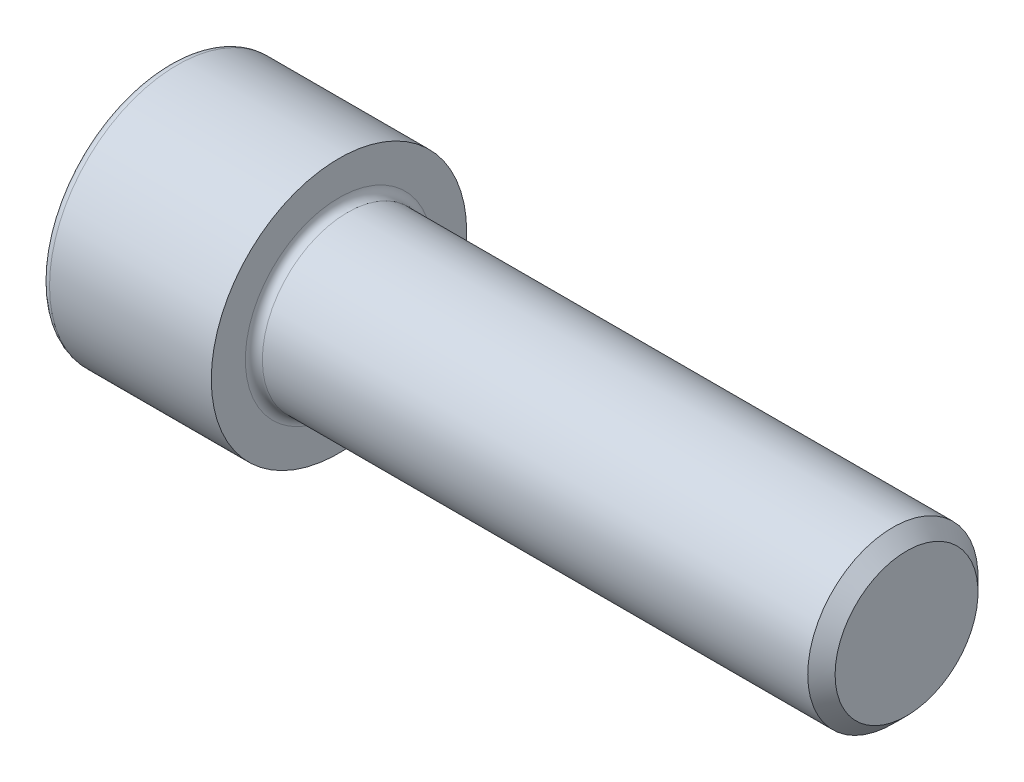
from build123d import *

# Parameters (mm, degrees)
FILLET1_R   = 0.6
FILLET2_R   = 0.6
HEX_2_DEPTH = 6


with BuildPart() as part:
    # BodySke → Base-Revolve (revolve)
    with BuildSketch(Plane.XY, mode=Mode.PRIVATE) as base_revolve_sk:
        Polygon((0, 0), (0, 9), (12, 9), (12, 6), (51.036, 6), (52, 5.036), (52, 0), align=None)
    revolve(base_revolve_sk.sketch.rotate(Axis((-31.75, 0, 0), (1, 0, 0)), 90), axis=Axis((-31.75, 0, 0), (1, 0, 0)))

    # Fillet1
    fillet1_edges = [part.edges().sort_by_distance(p)[0] for p in [
        (12, 0, -6),
    ]]
    fillet(fillet1_edges, radius=FILLET1_R)

    # Fillet2
    fillet2_edges = [part.edges().sort_by_distance(p)[0] for p in [
        (0, 0, -9),
    ]]
    fillet(fillet2_edges, radius=FILLET2_R)

    # Sketch2 → Hex-PreBroach (revolve, cut)
    with BuildSketch(Plane.XY, mode=Mode.PRIVATE) as hex_prebroach_sk:
        Polygon((0, 5.0575), (6, 5.0575), (8.919948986, 0), (0, 0), align=None)
    revolve(hex_prebroach_sk.sketch.rotate(Axis((0, 0, 0), (1, 0, 0)), 90), axis=Axis((0, 0, 0), (1, 0, 0)), mode=Mode.SUBTRACT)

    # Sketch3 → Hex 2 (cut)
    with BuildSketch(Plane(origin=(0, 0, 0), x_dir=(0, 0.500000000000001, 0.866025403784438), z_dir=(-1, 0, 0))):
        Polygon((2.919948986, 5.0575), (-2.919948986, 5.0575), (-5.839897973, 0), (-2.919948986, -5.0575), (2.919948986, -5.0575), (5.839897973, 0), align=None)
    extrude(amount=-HEX_2_DEPTH, mode=Mode.SUBTRACT)


solid = part.part
